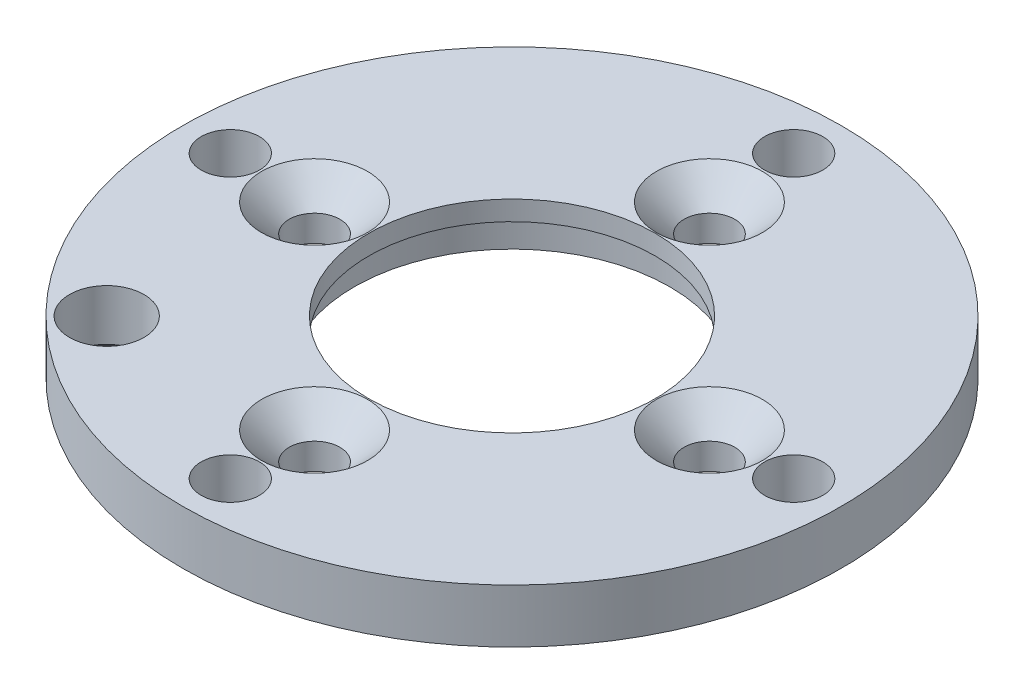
from build123d import *

# Parameters (mm, degrees)
SKETCH1_R                                       = 29.21
EXTRUDE1_DEPTH                                  = 4.7625
F_13_64_0_20313_DIAMETER_HOLE1_D                = 5.159502
CSK_FOR_M4_FLAT_HEAD_MACHINE_SCREW1_D           = 4.5
CSK_FOR_M4_FLAT_HEAD_MACHINE_SCREW1_CSINK_D     = 9.4
CSK_FOR_M4_FLAT_HEAD_MACHINE_SCREW1_CSINK_ANGLE = 90
SKETCH8_R                                       = 13.9954
CUT_EXTRUDE2_DEPTH                              = 3.0226
SKETCH9_R                                       = 12.7
CUT_EXTRUDE3_DEPTH                              = 3.81
CIRPATTERN1_COUNT                               = 4
SKETCH10_R                                      = 3.302
CUT_EXTRUDE4_DEPTH                              = 42.582804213
CHAMFER2_SIZE                                   = 0.254


with BuildPart() as part:
    # Sketch1 → Extrude1 (new body)
    with BuildSketch(Plane(origin=(0, 0, 0), x_dir=(1, 0, 0), z_dir=(0, 1, 0))):
        with Locations(Location((0, 0, 0), (0, 0, 90))):
            Circle(SKETCH1_R)
    extrude(amount=EXTRUDE1_DEPTH)

    # 13_64 _0.20313_ Diameter Hole1 (through all)
    with Locations(Plane(origin=(0, 4.7625, 24.9682), x_dir=(0, 0, 1), z_dir=(0, 1, 0))):
        with Locations((0, 0)):
            f_13_64_0_20313_diameter_hole1 = Hole(F_13_64_0_20313_DIAMETER_HOLE1_D / 2)

    # CSK for M4 Flat Head Machine Screw1 (through all)
    with Locations(Plane(origin=(0, 4.7625, 17.5006), x_dir=(0, 0, 1), z_dir=(0, 1, 0))):
        with Locations((0, 0)):
            csk_for_m4_flat_head_machine_screw1 = CounterSinkHole(CSK_FOR_M4_FLAT_HEAD_MACHINE_SCREW1_D / 2, CSK_FOR_M4_FLAT_HEAD_MACHINE_SCREW1_CSINK_D / 2, counter_sink_angle=CSK_FOR_M4_FLAT_HEAD_MACHINE_SCREW1_CSINK_ANGLE)

    # Sketch8 → Cut-Extrude2 (cut)
    with BuildSketch(Plane.XZ):
        with Locations(Location((0, 0, 0), (0, 0, 270))):
            Circle(SKETCH8_R)
    extrude(amount=-CUT_EXTRUDE2_DEPTH, mode=Mode.SUBTRACT)

    # Sketch9 → Cut-Extrude3 (cut)
    with BuildSketch(Plane(origin=(0, 4.7625, 0), x_dir=(-1, 0, 0), z_dir=(0, 1, 0))):
        with Locations(Location((0, 0, 0), (0, 0, 90))):
            Circle(SKETCH9_R)
    extrude(amount=-CUT_EXTRUDE3_DEPTH, mode=Mode.SUBTRACT)

    # CirPattern1: 13_64 _0.20313_ Diameter Hole1, CSK for M4 Flat Head Machine Screw1 ×4 about axis
    cirpattern1_axis = Axis((0, 0, 0), (0, 1, 0))
    add([f_13_64_0_20313_diameter_hole1.rotate(cirpattern1_axis, i * 360 / CIRPATTERN1_COUNT) for i in range(1, CIRPATTERN1_COUNT)], mode=Mode.SUBTRACT)
    add([csk_for_m4_flat_head_machine_screw1.rotate(cirpattern1_axis, i * 360 / CIRPATTERN1_COUNT) for i in range(1, CIRPATTERN1_COUNT)], mode=Mode.SUBTRACT)

    # Sketch10 → Cut-Extrude4 (cut, through all)
    with BuildSketch(Plane(origin=(0, 4.7625, 0), x_dir=(-1, 0, 0), z_dir=(0, 1, 0))):
        with Locations(Location((17.960512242, 17.960512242, 0), (0, 0, 90))):
            Circle(SKETCH10_R)
    extrude(amount=-CUT_EXTRUDE4_DEPTH, mode=Mode.SUBTRACT)

    # Chamfer2
    chamfer2_edges = [part.edges().sort_by_distance(p)[0] for p in [
        (-17.960512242, 0, 14.658512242),
    ]]
    chamfer(chamfer2_edges, length=CHAMFER2_SIZE)


solid = part.part
